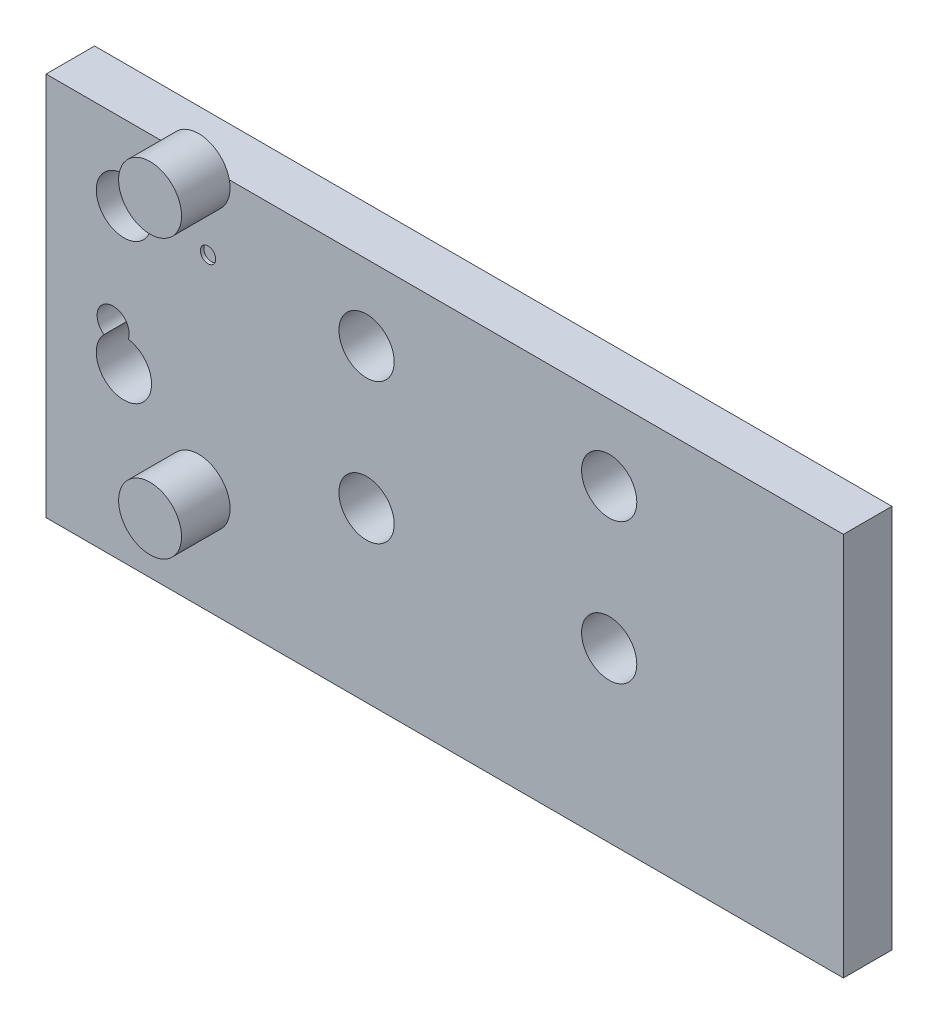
ISO-10303-21;
HEADER;
FILE_DESCRIPTION(('STEP AP214'),'2;1');
FILE_NAME('part.step','',(''),(''),'','','');
FILE_SCHEMA(('AUTOMOTIVE_DESIGN { 1 0 10303 214 1 1 1 1 }'));
ENDSEC;
DATA;
#1=APPLICATION_CONTEXT('core data for automotive mechanical design processes');
#2=APPLICATION_PROTOCOL_DEFINITION('international standard','automotive_design',2000,#1);
#3=PRODUCT_CONTEXT('',#1,'mechanical');
#4=PRODUCT('Part','Part','',(#3));
#5=PRODUCT_RELATED_PRODUCT_CATEGORY('part','',(#4));
#6=PRODUCT_DEFINITION_FORMATION('','',#4);
#7=PRODUCT_DEFINITION_CONTEXT('part definition',#1,'design');
#8=PRODUCT_DEFINITION('design','',#6,#7);
#9=PRODUCT_DEFINITION_SHAPE('','',#8);
#10=(LENGTH_UNIT() NAMED_UNIT(*) SI_UNIT(.MILLI.,.METRE.));
#11=(NAMED_UNIT(*) PLANE_ANGLE_UNIT() SI_UNIT($,.RADIAN.));
#12=(NAMED_UNIT(*) SI_UNIT($,.STERADIAN.) SOLID_ANGLE_UNIT());
#13=UNCERTAINTY_MEASURE_WITH_UNIT(LENGTH_MEASURE(1.E-05),#10,'distance_accuracy_value','');
#14=(GEOMETRIC_REPRESENTATION_CONTEXT(3) GLOBAL_UNCERTAINTY_ASSIGNED_CONTEXT((#13)) GLOBAL_UNIT_ASSIGNED_CONTEXT((#10,
#11,#12)) REPRESENTATION_CONTEXT('',''));
#15=CARTESIAN_POINT('',(0.,0.,0.));
#16=DIRECTION('',(0.,0.,1.));
#17=DIRECTION('',(1.,0.,0.));
#18=AXIS2_PLACEMENT_3D('',#15,#16,#17);
#19=CARTESIAN_POINT('',(-48.2675056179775,-15.525393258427,10.));
#20=DIRECTION('',(0.,0.,-1.));
#21=DIRECTION('',(-1.,0.,0.));
#22=AXIS2_PLACEMENT_3D('',#19,#20,#21);
#23=CYLINDRICAL_SURFACE('',#22,5.69264419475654);
#24=CARTESIAN_POINT('',(-48.2675056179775,-15.525393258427,10.));
#25=DIRECTION('',(0.,0.,1.));
#26=DIRECTION('',(1.,0.,0.));
#27=AXIS2_PLACEMENT_3D('',#24,#25,#26);
#28=CIRCLE('',#27,5.69264419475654);
#29=CARTESIAN_POINT('',(-42.574861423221,-15.525393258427,10.));
#30=VERTEX_POINT('',#29);
#31=EDGE_CURVE('E250',#30,#30,#28,.T.);
#32=ORIENTED_EDGE('',*,*,#31,.T.);
#33=EDGE_LOOP('',(#32));
#34=FACE_BOUND('',#33,.T.);
#35=CARTESIAN_POINT('',(-48.2675056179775,-15.525393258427,0.));
#36=DIRECTION('',(0.,0.,1.));
#37=DIRECTION('',(1.,0.,0.));
#38=AXIS2_PLACEMENT_3D('',#35,#36,#37);
#39=CIRCLE('',#38,5.69264419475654);
#40=CARTESIAN_POINT('',(-42.574861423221,-15.525393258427,0.));
#41=VERTEX_POINT('',#40);
#42=EDGE_CURVE('E253',#41,#41,#39,.T.);
#43=ORIENTED_EDGE('',*,*,#42,.F.);
#44=EDGE_LOOP('',(#43));
#45=FACE_BOUND('',#44,.T.);
#46=ADVANCED_FACE('F94',(#34,#45),#23,.F.);
#47=CARTESIAN_POINT('',(0.,0.,10.));
#48=DIRECTION('',(0.,0.,1.));
#49=DIRECTION('',(1.,0.,0.));
#50=AXIS2_PLACEMENT_3D('',#47,#48,#49);
#51=PLANE('',#50);
#52=CARTESIAN_POINT('',(-132.880054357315,-1.38128541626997,10.));
#53=DIRECTION('',(0.,0.,-1.));
#54=DIRECTION('',(1.,0.,0.));
#55=AXIS2_PLACEMENT_3D('',#52,#53,#54);
#56=CIRCLE('',#55,6.48241074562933);
#57=CARTESIAN_POINT('',(-126.546516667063,0.,10.));
#58=VERTEX_POINT('',#57);
#59=CARTESIAN_POINT('',(-139.213592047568,0.,10.));
#60=VERTEX_POINT('',#59);
#61=EDGE_CURVE('E163',#58,#60,#56,.T.);
#62=ORIENTED_EDGE('',*,*,#61,.T.);
#63=DIRECTION('',(-1.,0.,0.));
#64=VECTOR('',#63,1.);
#65=CARTESIAN_POINT('',(0.,0.,10.));
#66=LINE('',#65,#64);
#67=CARTESIAN_POINT('',(-164.310411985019,0.,10.));
#68=VERTEX_POINT('',#67);
#69=EDGE_CURVE('E151',#60,#68,#66,.T.);
#70=ORIENTED_EDGE('',*,*,#69,.T.);
#71=DIRECTION('',(0.,-1.,0.));
#72=VECTOR('',#71,1.);
#73=CARTESIAN_POINT('',(-164.310411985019,0.,10.));
#74=LINE('',#73,#72);
#75=CARTESIAN_POINT('',(-164.310411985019,-79.1795056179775,10.));
#76=VERTEX_POINT('',#75);
#77=EDGE_CURVE('E226',#68,#76,#74,.T.);
#78=ORIENTED_EDGE('',*,*,#77,.T.);
#79=DIRECTION('',(-1.,0.,0.));
#80=VECTOR('',#79,1.);
#81=CARTESIAN_POINT('',(0.,-79.1795056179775,10.));
#82=LINE('',#81,#80);
#83=CARTESIAN_POINT('',(0.,-79.1795056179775,10.));
#84=VERTEX_POINT('',#83);
#85=EDGE_CURVE('E228',#84,#76,#82,.T.);
#86=ORIENTED_EDGE('',*,*,#85,.F.);
#87=DIRECTION('',(0.,-1.,0.));
#88=VECTOR('',#87,1.);
#89=CARTESIAN_POINT('',(0.,0.,10.));
#90=LINE('',#89,#88);
#91=CARTESIAN_POINT('',(0.,0.,10.));
#92=VERTEX_POINT('',#91);
#93=EDGE_CURVE('E231',#92,#84,#90,.T.);
#94=ORIENTED_EDGE('',*,*,#93,.F.);
#95=EDGE_CURVE('E161',#92,#58,#66,.T.);
#96=ORIENTED_EDGE('',*,*,#95,.T.);
#97=EDGE_LOOP('',(#62,#70,#78,#86,#94,#96));
#98=FACE_BOUND('',#97,.T.);
#99=CARTESIAN_POINT('',(-132.880054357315,-58.61871458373,10.));
#100=DIRECTION('',(0.,0.,1.));
#101=DIRECTION('',(1.,0.,0.));
#102=AXIS2_PLACEMENT_3D('',#99,#100,#101);
#103=CIRCLE('',#102,6.48241074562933);
#104=CARTESIAN_POINT('',(-126.397643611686,-58.61871458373,10.));
#105=VERTEX_POINT('',#104);
#106=EDGE_CURVE('E177',#105,#105,#103,.T.);
#107=ORIENTED_EDGE('',*,*,#106,.F.);
#108=EDGE_LOOP('',(#107));
#109=FACE_BOUND('',#108,.T.);
#110=CARTESIAN_POINT('',(-148.267505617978,-44.474606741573,10.));
#111=DIRECTION('',(0.,0.,-1.));
#112=DIRECTION('',(1.,0.,0.));
#113=AXIS2_PLACEMENT_3D('',#110,#111,#112);
#114=CIRCLE('',#113,5.69264419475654);
#115=CARTESIAN_POINT('',(-147.364600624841,-38.8540230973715,10.));
#116=VERTEX_POINT('',#115);
#117=CARTESIAN_POINT('',(-152.366359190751,-40.5242146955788,10.));
#118=VERTEX_POINT('',#117);
#119=EDGE_CURVE('E186',#116,#118,#114,.T.);
#120=ORIENTED_EDGE('',*,*,#119,.T.);
#121=CARTESIAN_POINT('',(-150.494027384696,-37.8067942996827,10.));
#122=DIRECTION('',(0.,0.,1.));
#123=DIRECTION('',(1.,0.,0.));
#124=AXIS2_PLACEMENT_3D('',#121,#122,#123);
#125=CIRCLE('',#124,3.3);
#126=EDGE_CURVE('E207',#116,#118,#125,.T.);
#127=ORIENTED_EDGE('',*,*,#126,.F.);
#128=EDGE_LOOP('',(#120,#127));
#129=FACE_BOUND('',#128,.T.);
#130=CARTESIAN_POINT('',(-98.2675056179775,-44.474606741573,10.));
#131=DIRECTION('',(0.,0.,-1.));
#132=DIRECTION('',(1.,0.,0.));
#133=AXIS2_PLACEMENT_3D('',#130,#131,#132);
#134=CIRCLE('',#133,5.69264419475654);
#135=CARTESIAN_POINT('',(-92.574861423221,-44.474606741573,10.));
#136=VERTEX_POINT('',#135);
#137=EDGE_CURVE('E191',#136,#136,#134,.T.);
#138=ORIENTED_EDGE('',*,*,#137,.T.);
#139=EDGE_LOOP('',(#138));
#140=FACE_BOUND('',#139,.T.);
#141=CARTESIAN_POINT('',(-48.2675056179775,-44.474606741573,10.));
#142=DIRECTION('',(0.,0.,-1.));
#143=DIRECTION('',(1.,0.,0.));
#144=AXIS2_PLACEMENT_3D('',#141,#142,#143);
#145=CIRCLE('',#144,5.69264419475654);
#146=CARTESIAN_POINT('',(-42.574861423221,-44.474606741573,10.));
#147=VERTEX_POINT('',#146);
#148=EDGE_CURVE('E197',#147,#147,#145,.T.);
#149=ORIENTED_EDGE('',*,*,#148,.T.);
#150=EDGE_LOOP('',(#149));
#151=FACE_BOUND('',#150,.T.);
#152=CARTESIAN_POINT('',(-98.2675056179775,-15.525393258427,10.));
#153=DIRECTION('',(0.,0.,1.));
#154=DIRECTION('',(1.,0.,0.));
#155=AXIS2_PLACEMENT_3D('',#152,#153,#154);
#156=CIRCLE('',#155,5.69264419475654);
#157=CARTESIAN_POINT('',(-92.574861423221,-15.525393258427,10.));
#158=VERTEX_POINT('',#157);
#159=EDGE_CURVE('E189',#158,#158,#156,.T.);
#160=ORIENTED_EDGE('',*,*,#159,.F.);
#161=EDGE_LOOP('',(#160));
#162=FACE_BOUND('',#161,.T.);
#163=CARTESIAN_POINT('',(-130.93447489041,-15.5860641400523,10.));
#164=DIRECTION('',(0.,0.,1.));
#165=DIRECTION('',(1.,0.,0.));
#166=AXIS2_PLACEMENT_3D('',#163,#164,#165);
#167=CIRCLE('',#166,1.58749999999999);
#168=CARTESIAN_POINT('',(-129.34697489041,-15.5860641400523,10.));
#169=VERTEX_POINT('',#168);
#170=EDGE_CURVE('E216',#169,#169,#167,.T.);
#171=ORIENTED_EDGE('',*,*,#170,.F.);
#172=EDGE_LOOP('',(#171));
#173=FACE_BOUND('',#172,.T.);
#174=CARTESIAN_POINT('',(-148.267505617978,-15.525393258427,10.));
#175=DIRECTION('',(0.,0.,1.));
#176=DIRECTION('',(1.,0.,0.));
#177=AXIS2_PLACEMENT_3D('',#174,#175,#176);
#178=CIRCLE('',#177,5.69264419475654);
#179=CARTESIAN_POINT('',(-142.574861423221,-15.525393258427,10.));
#180=VERTEX_POINT('',#179);
#181=EDGE_CURVE('E220',#180,#180,#178,.T.);
#182=ORIENTED_EDGE('',*,*,#181,.F.);
#183=EDGE_LOOP('',(#182));
#184=FACE_BOUND('',#183,.T.);
#185=ORIENTED_EDGE('',*,*,#31,.F.);
#186=EDGE_LOOP('',(#185));
#187=FACE_BOUND('',#186,.T.);
#188=ADVANCED_FACE('F164',(#98,#109,#129,#140,#151,#162,#173,#184,#187),#51,.T.);
#189=CARTESIAN_POINT('',(0.,0.,0.));
#190=DIRECTION('',(0.,0.,1.));
#191=DIRECTION('',(1.,0.,0.));
#192=AXIS2_PLACEMENT_3D('',#189,#190,#191);
#193=PLANE('',#192);
#194=CARTESIAN_POINT('',(-98.2675056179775,-44.474606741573,0.));
#195=DIRECTION('',(0.,0.,-1.));
#196=DIRECTION('',(1.,0.,0.));
#197=AXIS2_PLACEMENT_3D('',#194,#195,#196);
#198=CIRCLE('',#197,5.69264419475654);
#199=CARTESIAN_POINT('',(-92.574861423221,-44.474606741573,0.));
#200=VERTEX_POINT('',#199);
#201=EDGE_CURVE('E194',#200,#200,#198,.T.);
#202=ORIENTED_EDGE('',*,*,#201,.F.);
#203=EDGE_LOOP('',(#202));
#204=FACE_BOUND('',#203,.T.);
#205=CARTESIAN_POINT('',(-48.2675056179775,-44.474606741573,0.));
#206=DIRECTION('',(0.,0.,-1.));
#207=DIRECTION('',(1.,0.,0.));
#208=AXIS2_PLACEMENT_3D('',#205,#206,#207);
#209=CIRCLE('',#208,5.69264419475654);
#210=CARTESIAN_POINT('',(-42.574861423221,-44.474606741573,0.));
#211=VERTEX_POINT('',#210);
#212=EDGE_CURVE('E183',#211,#211,#209,.T.);
#213=ORIENTED_EDGE('',*,*,#212,.F.);
#214=EDGE_LOOP('',(#213));
#215=FACE_BOUND('',#214,.T.);
#216=CARTESIAN_POINT('',(-98.2675056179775,-15.525393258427,0.));
#217=DIRECTION('',(0.,0.,1.));
#218=DIRECTION('',(1.,0.,0.));
#219=AXIS2_PLACEMENT_3D('',#216,#217,#218);
#220=CIRCLE('',#219,5.69264419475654);
#221=CARTESIAN_POINT('',(-92.574861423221,-15.525393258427,0.));
#222=VERTEX_POINT('',#221);
#223=EDGE_CURVE('E204',#222,#222,#220,.T.);
#224=ORIENTED_EDGE('',*,*,#223,.T.);
#225=EDGE_LOOP('',(#224));
#226=FACE_BOUND('',#225,.T.);
#227=CARTESIAN_POINT('',(-150.494027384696,-37.8067942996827,0.));
#228=DIRECTION('',(0.,0.,1.));
#229=DIRECTION('',(1.,0.,0.));
#230=AXIS2_PLACEMENT_3D('',#227,#228,#229);
#231=CIRCLE('',#230,3.3);
#232=CARTESIAN_POINT('',(-147.364600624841,-38.8540230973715,0.));
#233=VERTEX_POINT('',#232);
#234=CARTESIAN_POINT('',(-152.366359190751,-40.5242146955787,0.));
#235=VERTEX_POINT('',#234);
#236=EDGE_CURVE('E210',#233,#235,#231,.T.);
#237=ORIENTED_EDGE('',*,*,#236,.T.);
#238=CARTESIAN_POINT('',(-148.267505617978,-44.474606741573,0.));
#239=DIRECTION('',(0.,0.,-1.));
#240=DIRECTION('',(1.,0.,0.));
#241=AXIS2_PLACEMENT_3D('',#238,#239,#240);
#242=CIRCLE('',#241,5.69264419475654);
#243=EDGE_CURVE('E116',#233,#235,#242,.T.);
#244=ORIENTED_EDGE('',*,*,#243,.F.);
#245=EDGE_LOOP('',(#237,#244));
#246=FACE_BOUND('',#245,.T.);
#247=CARTESIAN_POINT('',(-148.267505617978,-15.525393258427,0.));
#248=DIRECTION('',(0.,0.,1.));
#249=DIRECTION('',(1.,0.,0.));
#250=AXIS2_PLACEMENT_3D('',#247,#248,#249);
#251=CIRCLE('',#250,5.69264419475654);
#252=CARTESIAN_POINT('',(-142.574861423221,-15.525393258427,0.));
#253=VERTEX_POINT('',#252);
#254=EDGE_CURVE('E219',#253,#253,#251,.T.);
#255=ORIENTED_EDGE('',*,*,#254,.T.);
#256=EDGE_LOOP('',(#255));
#257=FACE_BOUND('',#256,.T.);
#258=DIRECTION('',(-1.,0.,0.));
#259=VECTOR('',#258,1.);
#260=CARTESIAN_POINT('',(0.,0.,0.));
#261=LINE('',#260,#259);
#262=CARTESIAN_POINT('',(0.,0.,0.));
#263=VERTEX_POINT('',#262);
#264=CARTESIAN_POINT('',(-164.310411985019,0.,0.));
#265=VERTEX_POINT('',#264);
#266=EDGE_CURVE('E223',#263,#265,#261,.T.);
#267=ORIENTED_EDGE('',*,*,#266,.F.);
#268=DIRECTION('',(0.,-1.,0.));
#269=VECTOR('',#268,1.);
#270=CARTESIAN_POINT('',(0.,0.,0.));
#271=LINE('',#270,#269);
#272=CARTESIAN_POINT('',(0.,-79.1795056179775,0.));
#273=VERTEX_POINT('',#272);
#274=EDGE_CURVE('E159',#263,#273,#271,.T.);
#275=ORIENTED_EDGE('',*,*,#274,.T.);
#276=DIRECTION('',(-1.,0.,0.));
#277=VECTOR('',#276,1.);
#278=CARTESIAN_POINT('',(0.,-79.1795056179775,0.));
#279=LINE('',#278,#277);
#280=CARTESIAN_POINT('',(-164.310411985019,-79.1795056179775,0.));
#281=VERTEX_POINT('',#280);
#282=EDGE_CURVE('E239',#273,#281,#279,.T.);
#283=ORIENTED_EDGE('',*,*,#282,.T.);
#284=DIRECTION('',(0.,-1.,0.));
#285=VECTOR('',#284,1.);
#286=CARTESIAN_POINT('',(-164.310411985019,0.,0.));
#287=LINE('',#286,#285);
#288=EDGE_CURVE('E236',#265,#281,#287,.T.);
#289=ORIENTED_EDGE('',*,*,#288,.F.);
#290=EDGE_LOOP('',(#267,#275,#283,#289));
#291=FACE_BOUND('',#290,.T.);
#292=ORIENTED_EDGE('',*,*,#42,.T.);
#293=EDGE_LOOP('',(#292));
#294=FACE_BOUND('',#293,.T.);
#295=ADVANCED_FACE('F260',(#204,#215,#226,#246,#257,#291,#294),#193,.F.);
#296=CARTESIAN_POINT('',(-164.310411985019,0.,10.));
#297=DIRECTION('',(1.,0.,0.));
#298=DIRECTION('',(0.,0.,-1.));
#299=AXIS2_PLACEMENT_3D('',#296,#297,#298);
#300=PLANE('',#299);
#301=ORIENTED_EDGE('',*,*,#288,.T.);
#302=DIRECTION('',(0.,0.,-1.));
#303=VECTOR('',#302,1.);
#304=CARTESIAN_POINT('',(-164.310411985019,-79.1795056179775,10.));
#305=LINE('',#304,#303);
#306=EDGE_CURVE('E247',#76,#281,#305,.T.);
#307=ORIENTED_EDGE('',*,*,#306,.F.);
#308=ORIENTED_EDGE('',*,*,#77,.F.);
#309=DIRECTION('',(0.,0.,-1.));
#310=VECTOR('',#309,1.);
#311=CARTESIAN_POINT('',(-164.310411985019,0.,10.));
#312=LINE('',#311,#310);
#313=EDGE_CURVE('E156',#68,#265,#312,.T.);
#314=ORIENTED_EDGE('',*,*,#313,.T.);
#315=EDGE_LOOP('',(#301,#307,#308,#314));
#316=FACE_BOUND('',#315,.T.);
#317=ADVANCED_FACE('F263',(#316),#300,.F.);
#318=CARTESIAN_POINT('',(0.,-79.1795056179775,10.));
#319=DIRECTION('',(0.,-1.,0.));
#320=DIRECTION('',(0.,0.,-1.));
#321=AXIS2_PLACEMENT_3D('',#318,#319,#320);
#322=PLANE('',#321);
#323=ORIENTED_EDGE('',*,*,#282,.F.);
#324=DIRECTION('',(0.,0.,-1.));
#325=VECTOR('',#324,1.);
#326=CARTESIAN_POINT('',(0.,-79.1795056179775,10.));
#327=LINE('',#326,#325);
#328=EDGE_CURVE('E245',#84,#273,#327,.T.);
#329=ORIENTED_EDGE('',*,*,#328,.F.);
#330=ORIENTED_EDGE('',*,*,#85,.T.);
#331=ORIENTED_EDGE('',*,*,#306,.T.);
#332=EDGE_LOOP('',(#323,#329,#330,#331));
#333=FACE_BOUND('',#332,.T.);
#334=ADVANCED_FACE('F293',(#333),#322,.T.);
#335=CARTESIAN_POINT('',(0.,0.,10.));
#336=DIRECTION('',(1.,0.,0.));
#337=DIRECTION('',(0.,0.,-1.));
#338=AXIS2_PLACEMENT_3D('',#335,#336,#337);
#339=PLANE('',#338);
#340=ORIENTED_EDGE('',*,*,#274,.F.);
#341=DIRECTION('',(0.,0.,-1.));
#342=VECTOR('',#341,1.);
#343=CARTESIAN_POINT('',(0.,0.,10.));
#344=LINE('',#343,#342);
#345=EDGE_CURVE('E234',#92,#263,#344,.T.);
#346=ORIENTED_EDGE('',*,*,#345,.F.);
#347=ORIENTED_EDGE('',*,*,#93,.T.);
#348=ORIENTED_EDGE('',*,*,#328,.T.);
#349=EDGE_LOOP('',(#340,#346,#347,#348));
#350=FACE_BOUND('',#349,.T.);
#351=ADVANCED_FACE('F289',(#350),#339,.T.);
#352=CARTESIAN_POINT('',(0.,0.,10.));
#353=DIRECTION('',(0.,-1.,0.));
#354=DIRECTION('',(0.,0.,-1.));
#355=AXIS2_PLACEMENT_3D('',#352,#353,#354);
#356=PLANE('',#355);
#357=ORIENTED_EDGE('',*,*,#266,.T.);
#358=ORIENTED_EDGE('',*,*,#313,.F.);
#359=ORIENTED_EDGE('',*,*,#69,.F.);
#360=EDGE_CURVE('E108',#58,#60,#66,.T.);
#361=ORIENTED_EDGE('',*,*,#360,.F.);
#362=ORIENTED_EDGE('',*,*,#95,.F.);
#363=ORIENTED_EDGE('',*,*,#345,.T.);
#364=EDGE_LOOP('',(#357,#358,#359,#361,#362,#363));
#365=FACE_BOUND('',#364,.T.);
#366=ADVANCED_FACE('F154',(#365),#356,.F.);
#367=CARTESIAN_POINT('',(-148.267505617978,-15.525393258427,10.));
#368=DIRECTION('',(0.,0.,-1.));
#369=DIRECTION('',(-1.,0.,0.));
#370=AXIS2_PLACEMENT_3D('',#367,#368,#369);
#371=CYLINDRICAL_SURFACE('',#370,5.69264419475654);
#372=ORIENTED_EDGE('',*,*,#181,.T.);
#373=EDGE_LOOP('',(#372));
#374=FACE_BOUND('',#373,.T.);
#375=ORIENTED_EDGE('',*,*,#254,.F.);
#376=EDGE_LOOP('',(#375));
#377=FACE_BOUND('',#376,.T.);
#378=ADVANCED_FACE('F279',(#374,#377),#371,.F.);
#379=CARTESIAN_POINT('',(-130.93447489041,-15.5860641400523,10.));
#380=DIRECTION('',(0.,0.,1.));
#381=DIRECTION('',(1.,0.,0.));
#382=AXIS2_PLACEMENT_3D('',#379,#380,#381);
#383=CYLINDRICAL_SURFACE('',#382,1.58749999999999);
#384=CARTESIAN_POINT('',(-130.93447489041,-15.5860641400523,9.2888));
#385=DIRECTION('',(0.,0.,1.));
#386=DIRECTION('',(1.,0.,0.));
#387=AXIS2_PLACEMENT_3D('',#384,#385,#386);
#388=CIRCLE('',#387,1.58749999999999);
#389=CARTESIAN_POINT('',(-129.34697489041,-15.5860641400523,9.2888));
#390=VERTEX_POINT('',#389);
#391=EDGE_CURVE('E213',#390,#390,#388,.T.);
#392=ORIENTED_EDGE('',*,*,#391,.F.);
#393=EDGE_LOOP('',(#392));
#394=FACE_BOUND('',#393,.T.);
#395=ORIENTED_EDGE('',*,*,#170,.T.);
#396=EDGE_LOOP('',(#395));
#397=FACE_BOUND('',#396,.T.);
#398=ADVANCED_FACE('F286',(#394,#397),#383,.F.);
#399=CARTESIAN_POINT('',(-129.34697489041,-15.5860641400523,9.2888));
#400=DIRECTION('',(0.,0.,-1.));
#401=DIRECTION('',(-1.,0.,0.));
#402=AXIS2_PLACEMENT_3D('',#399,#400,#401);
#403=PLANE('',#402);
#404=ORIENTED_EDGE('',*,*,#391,.T.);
#405=EDGE_LOOP('',(#404));
#406=FACE_BOUND('',#405,.T.);
#407=ADVANCED_FACE('F331',(#406),#403,.F.);
#408=CARTESIAN_POINT('',(-150.494027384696,-37.8067942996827,10.));
#409=DIRECTION('',(0.,0.,1.));
#410=DIRECTION('',(1.,0.,0.));
#411=AXIS2_PLACEMENT_3D('',#408,#409,#410);
#412=CYLINDRICAL_SURFACE('',#411,3.3);
#413=ORIENTED_EDGE('',*,*,#236,.F.);
#414=DIRECTION('',(0.,0.,-1.));
#415=VECTOR('',#414,1.);
#416=CARTESIAN_POINT('',(-147.364600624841,-38.8540230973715,5.));
#417=LINE('',#416,#415);
#418=EDGE_CURVE('E12',#233,#116,#417,.F.);
#419=ORIENTED_EDGE('',*,*,#418,.T.);
#420=ORIENTED_EDGE('',*,*,#126,.T.);
#421=DIRECTION('',(0.,0.,-1.));
#422=VECTOR('',#421,1.);
#423=CARTESIAN_POINT('',(-152.366359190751,-40.5242146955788,5.));
#424=LINE('',#423,#422);
#425=EDGE_CURVE('E101',#118,#235,#424,.T.);
#426=ORIENTED_EDGE('',*,*,#425,.T.);
#427=EDGE_LOOP('',(#413,#419,#420,#426));
#428=FACE_BOUND('',#427,.T.);
#429=ADVANCED_FACE('F257',(#428),#412,.F.);
#430=CARTESIAN_POINT('',(-98.2675056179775,-15.525393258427,10.));
#431=DIRECTION('',(0.,0.,-1.));
#432=DIRECTION('',(-1.,0.,0.));
#433=AXIS2_PLACEMENT_3D('',#430,#431,#432);
#434=CYLINDRICAL_SURFACE('',#433,5.69264419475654);
#435=ORIENTED_EDGE('',*,*,#159,.T.);
#436=EDGE_LOOP('',(#435));
#437=FACE_BOUND('',#436,.T.);
#438=ORIENTED_EDGE('',*,*,#223,.F.);
#439=EDGE_LOOP('',(#438));
#440=FACE_BOUND('',#439,.T.);
#441=ADVANCED_FACE('F353',(#437,#440),#434,.F.);
#442=CARTESIAN_POINT('',(-148.267505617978,-44.474606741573,10.));
#443=DIRECTION('',(0.,0.,-1.));
#444=DIRECTION('',(-1.,0.,0.));
#445=AXIS2_PLACEMENT_3D('',#442,#443,#444);
#446=CYLINDRICAL_SURFACE('',#445,5.69264419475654);
#447=ORIENTED_EDGE('',*,*,#243,.T.);
#448=ORIENTED_EDGE('',*,*,#425,.F.);
#449=ORIENTED_EDGE('',*,*,#119,.F.);
#450=ORIENTED_EDGE('',*,*,#418,.F.);
#451=EDGE_LOOP('',(#447,#448,#449,#450));
#452=FACE_BOUND('',#451,.T.);
#453=ADVANCED_FACE('F357',(#452),#446,.F.);
#454=CARTESIAN_POINT('',(-48.2675056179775,-44.474606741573,10.));
#455=DIRECTION('',(0.,0.,-1.));
#456=DIRECTION('',(-1.,0.,0.));
#457=AXIS2_PLACEMENT_3D('',#454,#455,#456);
#458=CYLINDRICAL_SURFACE('',#457,5.69264419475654);
#459=ORIENTED_EDGE('',*,*,#148,.F.);
#460=EDGE_LOOP('',(#459));
#461=FACE_BOUND('',#460,.T.);
#462=ORIENTED_EDGE('',*,*,#212,.T.);
#463=EDGE_LOOP('',(#462));
#464=FACE_BOUND('',#463,.T.);
#465=ADVANCED_FACE('F381',(#461,#464),#458,.F.);
#466=CARTESIAN_POINT('',(-98.2675056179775,-44.474606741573,10.));
#467=DIRECTION('',(0.,0.,-1.));
#468=DIRECTION('',(-1.,0.,0.));
#469=AXIS2_PLACEMENT_3D('',#466,#467,#468);
#470=CYLINDRICAL_SURFACE('',#469,5.69264419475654);
#471=ORIENTED_EDGE('',*,*,#137,.F.);
#472=EDGE_LOOP('',(#471));
#473=FACE_BOUND('',#472,.T.);
#474=ORIENTED_EDGE('',*,*,#201,.T.);
#475=EDGE_LOOP('',(#474));
#476=FACE_BOUND('',#475,.T.);
#477=ADVANCED_FACE('F390',(#473,#476),#470,.F.);
#478=CARTESIAN_POINT('',(-132.880054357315,-58.61871458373,20.));
#479=DIRECTION('',(0.,0.,-1.));
#480=DIRECTION('',(-1.,0.,0.));
#481=AXIS2_PLACEMENT_3D('',#478,#479,#480);
#482=CYLINDRICAL_SURFACE('',#481,6.48241074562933);
#483=CARTESIAN_POINT('',(-132.880054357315,-58.61871458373,20.));
#484=DIRECTION('',(0.,0.,1.));
#485=DIRECTION('',(1.,0.,0.));
#486=AXIS2_PLACEMENT_3D('',#483,#484,#485);
#487=CIRCLE('',#486,6.48241074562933);
#488=CARTESIAN_POINT('',(-126.397643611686,-58.61871458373,20.));
#489=VERTEX_POINT('',#488);
#490=EDGE_CURVE('E180',#489,#489,#487,.T.);
#491=ORIENTED_EDGE('',*,*,#490,.F.);
#492=EDGE_LOOP('',(#491));
#493=FACE_BOUND('',#492,.T.);
#494=ORIENTED_EDGE('',*,*,#106,.T.);
#495=EDGE_LOOP('',(#494));
#496=FACE_BOUND('',#495,.T.);
#497=ADVANCED_FACE('F400',(#493,#496),#482,.T.);
#498=CARTESIAN_POINT('',(-132.880054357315,-58.61871458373,20.));
#499=DIRECTION('',(0.,0.,1.));
#500=DIRECTION('',(1.,0.,0.));
#501=AXIS2_PLACEMENT_3D('',#498,#499,#500);
#502=PLANE('',#501);
#503=ORIENTED_EDGE('',*,*,#490,.T.);
#504=EDGE_LOOP('',(#503));
#505=FACE_BOUND('',#504,.T.);
#506=ADVANCED_FACE('F410',(#505),#502,.T.);
#507=CARTESIAN_POINT('',(-132.880054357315,-1.38128541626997,10.));
#508=DIRECTION('',(0.,0.,1.));
#509=DIRECTION('',(1.,0.,0.));
#510=AXIS2_PLACEMENT_3D('',#507,#508,#509);
#511=PLANE('',#510);
#512=EDGE_CURVE('E170',#60,#58,#56,.T.);
#513=ORIENTED_EDGE('',*,*,#512,.T.);
#514=ORIENTED_EDGE('',*,*,#360,.T.);
#515=EDGE_LOOP('',(#513,#514));
#516=FACE_BOUND('',#515,.T.);
#517=ADVANCED_FACE('F173',(#516),#511,.F.);
#518=CARTESIAN_POINT('',(-132.880054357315,-1.38128541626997,20.));
#519=DIRECTION('',(0.,0.,-1.));
#520=DIRECTION('',(-1.,0.,0.));
#521=AXIS2_PLACEMENT_3D('',#518,#519,#520);
#522=CYLINDRICAL_SURFACE('',#521,6.48241074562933);
#523=CARTESIAN_POINT('',(-132.880054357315,-1.38128541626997,20.));
#524=DIRECTION('',(0.,0.,-1.));
#525=DIRECTION('',(1.,0.,0.));
#526=AXIS2_PLACEMENT_3D('',#523,#524,#525);
#527=CIRCLE('',#526,6.48241074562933);
#528=CARTESIAN_POINT('',(-126.397643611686,-1.38128541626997,20.));
#529=VERTEX_POINT('',#528);
#530=EDGE_CURVE('E175',#529,#529,#527,.T.);
#531=ORIENTED_EDGE('',*,*,#530,.T.);
#532=EDGE_LOOP('',(#531));
#533=FACE_BOUND('',#532,.T.);
#534=ORIENTED_EDGE('',*,*,#512,.F.);
#535=ORIENTED_EDGE('',*,*,#61,.F.);
#536=EDGE_LOOP('',(#534,#535));
#537=FACE_BOUND('',#536,.T.);
#538=ADVANCED_FACE('F174',(#533,#537),#522,.T.);
#539=CARTESIAN_POINT('',(-132.880054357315,-1.38128541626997,20.));
#540=DIRECTION('',(0.,0.,1.));
#541=DIRECTION('',(1.,0.,0.));
#542=AXIS2_PLACEMENT_3D('',#539,#540,#541);
#543=PLANE('',#542);
#544=ORIENTED_EDGE('',*,*,#530,.F.);
#545=EDGE_LOOP('',(#544));
#546=FACE_BOUND('',#545,.T.);
#547=ADVANCED_FACE('F443',(#546),#543,.T.);
#548=CLOSED_SHELL('',(#46,#188,#295,#317,#334,#351,#366,#378,#398,#407,#429,#441,#453,#465,#477,
#497,#506,#517,#538,#547));
#549=MANIFOLD_SOLID_BREP('B2',#548);
#550=ADVANCED_BREP_SHAPE_REPRESENTATION('',(#18,#549),#14);
#551=SHAPE_DEFINITION_REPRESENTATION(#9,#550);
ENDSEC;
END-ISO-10303-21;
